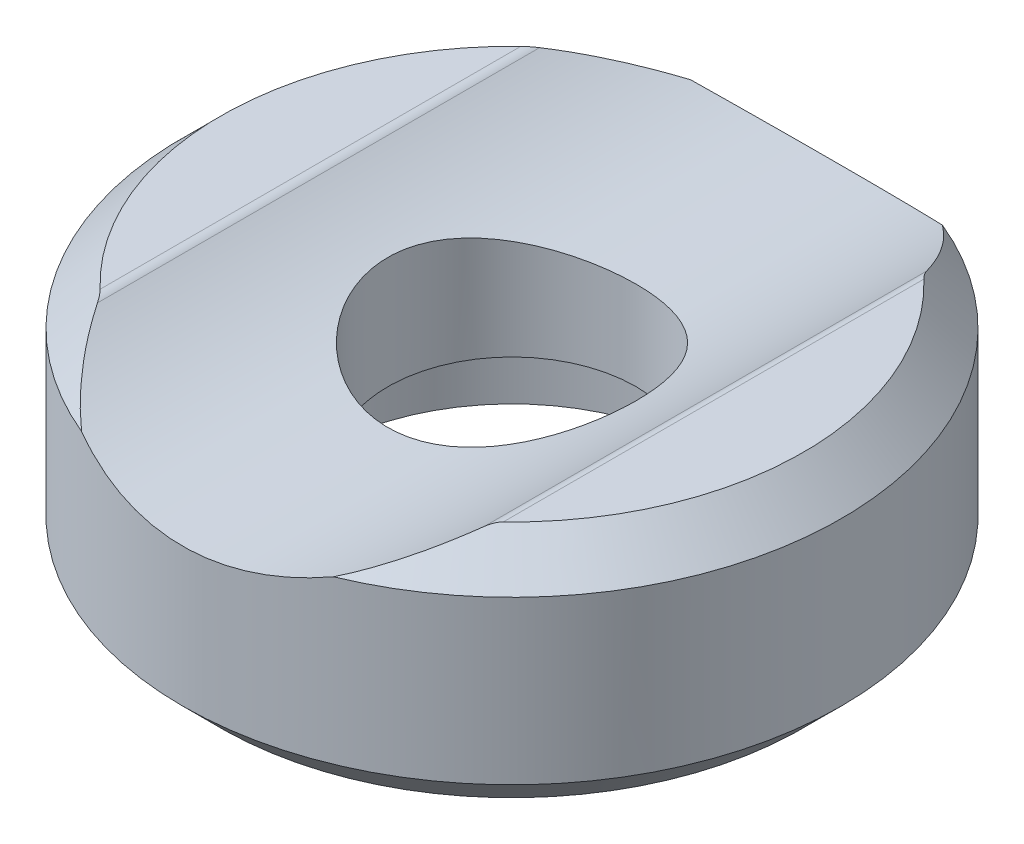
ISO-10303-21;
HEADER;
FILE_DESCRIPTION(('STEP AP214'),'2;1');
FILE_NAME('part.step','',(''),(''),'','','');
FILE_SCHEMA(('AUTOMOTIVE_DESIGN { 1 0 10303 214 1 1 1 1 }'));
ENDSEC;
DATA;
#1=APPLICATION_CONTEXT('core data for automotive mechanical design processes');
#2=APPLICATION_PROTOCOL_DEFINITION('international standard','automotive_design',2000,#1);
#3=PRODUCT_CONTEXT('',#1,'mechanical');
#4=PRODUCT('Part','Part','',(#3));
#5=PRODUCT_RELATED_PRODUCT_CATEGORY('part','',(#4));
#6=PRODUCT_DEFINITION_FORMATION('','',#4);
#7=PRODUCT_DEFINITION_CONTEXT('part definition',#1,'design');
#8=PRODUCT_DEFINITION('design','',#6,#7);
#9=PRODUCT_DEFINITION_SHAPE('','',#8);
#10=(LENGTH_UNIT() NAMED_UNIT(*) SI_UNIT(.MILLI.,.METRE.));
#11=(NAMED_UNIT(*) PLANE_ANGLE_UNIT() SI_UNIT($,.RADIAN.));
#12=(NAMED_UNIT(*) SI_UNIT($,.STERADIAN.) SOLID_ANGLE_UNIT());
#13=UNCERTAINTY_MEASURE_WITH_UNIT(LENGTH_MEASURE(1.E-05),#10,'distance_accuracy_value','');
#14=(GEOMETRIC_REPRESENTATION_CONTEXT(3) GLOBAL_UNCERTAINTY_ASSIGNED_CONTEXT((#13)) GLOBAL_UNIT_ASSIGNED_CONTEXT((#10,
#11,#12)) REPRESENTATION_CONTEXT('',''));
#15=CARTESIAN_POINT('',(0.,0.,0.));
#16=DIRECTION('',(0.,0.,1.));
#17=DIRECTION('',(1.,0.,0.));
#18=AXIS2_PLACEMENT_3D('',#15,#16,#17);
#19=CARTESIAN_POINT('',(0.,0.,0.));
#20=DIRECTION('',(0.,-1.,0.));
#21=DIRECTION('',(0.,0.,-1.));
#22=AXIS2_PLACEMENT_3D('',#19,#20,#21);
#23=CYLINDRICAL_SURFACE('',#22,2.6);
#24=CARTESIAN_POINT('',(0.,3.7,-2.6));
#25=CARTESIAN_POINT('',(-0.141171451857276,3.69999755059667,-2.60000337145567));
#26=CARTESIAN_POINT('',(-0.282319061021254,3.7041888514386,-2.58846577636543));
#27=CARTESIAN_POINT('',(-0.560416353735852,3.72049212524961,-2.5427910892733));
#28=CARTESIAN_POINT('',(-0.69736629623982,3.73260360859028,-2.50865539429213));
#29=CARTESIAN_POINT('',(-0.963018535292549,3.76344161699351,-2.41913541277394));
#30=CARTESIAN_POINT('',(-1.0917355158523,3.78215595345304,-2.36379026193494));
#31=CARTESIAN_POINT('',(-1.33805364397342,3.82432000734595,-2.23361385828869));
#32=CARTESIAN_POINT('',(-1.45565204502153,3.84777089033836,-2.15877780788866));
#33=CARTESIAN_POINT('',(-1.68107704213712,3.89801451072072,-1.98862565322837));
#34=CARTESIAN_POINT('',(-1.78840139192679,3.9248969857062,-1.89267086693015));
#35=CARTESIAN_POINT('',(-1.9858324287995,3.978514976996,-1.68436129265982));
#36=CARTESIAN_POINT('',(-2.07593438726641,4.00525045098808,-1.57200201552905));
#37=CARTESIAN_POINT('',(-2.23944189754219,4.0565714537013,-1.32929973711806));
#38=CARTESIAN_POINT('',(-2.31215766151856,4.0810498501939,-1.19846713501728));
#39=CARTESIAN_POINT('',(-2.4343324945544,4.12369983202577,-0.925404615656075));
#40=CARTESIAN_POINT('',(-2.4838000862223,4.14187372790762,-0.783178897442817));
#41=CARTESIAN_POINT('',(-2.55612524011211,4.16890265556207,-0.497128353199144));
#42=CARTESIAN_POINT('',(-2.57993578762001,4.17809015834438,-0.353576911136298));
#43=CARTESIAN_POINT('',(-2.60325097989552,4.18708290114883,-0.064244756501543));
#44=CARTESIAN_POINT('',(-2.60276474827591,4.18689166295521,0.0815350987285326));
#45=CARTESIAN_POINT('',(-2.57823269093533,4.17743682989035,0.362679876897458));
#46=CARTESIAN_POINT('',(-2.555480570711,4.16867142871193,0.498177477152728));
#47=CARTESIAN_POINT('',(-2.48919153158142,4.14387946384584,0.763283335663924));
#48=CARTESIAN_POINT('',(-2.445651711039,4.1278518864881,0.892890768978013));
#49=CARTESIAN_POINT('',(-2.33826694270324,4.09002299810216,1.14527717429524));
#50=CARTESIAN_POINT('',(-2.27407027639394,4.06812286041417,1.26789103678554));
#51=CARTESIAN_POINT('',(-2.12743878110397,4.02105229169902,1.50099285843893));
#52=CARTESIAN_POINT('',(-2.04499798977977,3.99588079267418,1.61147683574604));
#53=CARTESIAN_POINT('',(-1.85819817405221,3.94319963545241,1.8243827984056));
#54=CARTESIAN_POINT('',(-1.75279759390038,3.91564173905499,1.9258811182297));
#55=CARTESIAN_POINT('',(-1.52614487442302,3.86264166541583,2.11002476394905));
#56=CARTESIAN_POINT('',(-1.40489064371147,3.83719976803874,2.19266759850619));
#57=CARTESIAN_POINT('',(-1.14775464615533,3.79085596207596,2.33767516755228));
#58=CARTESIAN_POINT('',(-1.01169856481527,3.77001949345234,2.39975318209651));
#59=CARTESIAN_POINT('',(-0.730136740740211,3.73571557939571,2.49983963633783));
#60=CARTESIAN_POINT('',(-0.584634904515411,3.72224510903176,2.53785795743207));
#61=CARTESIAN_POINT('',(-0.296101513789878,3.70471216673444,2.58701851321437));
#62=CARTESIAN_POINT('',(-0.153308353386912,3.70021420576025,2.59940597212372));
#63=CARTESIAN_POINT('',(0.132369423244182,3.69980101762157,2.60055187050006));
#64=CARTESIAN_POINT('',(0.275254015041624,3.70388404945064,2.5893151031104));
#65=CARTESIAN_POINT('',(0.551815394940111,3.71988630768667,2.54449247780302));
#66=CARTESIAN_POINT('',(0.685639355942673,3.73152559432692,2.51170451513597));
#67=CARTESIAN_POINT('',(0.945807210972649,3.76119017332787,2.42574240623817));
#68=CARTESIAN_POINT('',(1.07215013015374,3.77921629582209,2.37256560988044));
#69=CARTESIAN_POINT('',(1.31779546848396,3.82049592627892,2.24567814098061));
#70=CARTESIAN_POINT('',(1.43679475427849,3.84388373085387,2.17142562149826));
#71=CARTESIAN_POINT('',(1.66102906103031,3.89327560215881,2.00511452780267));
#72=CARTESIAN_POINT('',(1.76625925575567,3.91928058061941,1.91304973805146));
#73=CARTESIAN_POINT('',(1.9658693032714,3.97276318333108,1.70789928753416));
#74=CARTESIAN_POINT('',(2.0593630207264,4.00024489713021,1.59395028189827));
#75=CARTESIAN_POINT('',(2.22605424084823,4.05220263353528,1.35141877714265));
#76=CARTESIAN_POINT('',(2.29925058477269,4.07667848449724,1.22283544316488));
#77=CARTESIAN_POINT('',(2.42317593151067,4.119693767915,0.954017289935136));
#78=CARTESIAN_POINT('',(2.47386671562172,4.13822308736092,0.813763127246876));
#79=CARTESIAN_POINT('',(2.55061337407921,4.16679266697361,0.525863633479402));
#80=CARTESIAN_POINT('',(2.57668300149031,4.17683766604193,0.378222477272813));
#81=CARTESIAN_POINT('',(2.60226836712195,4.18670207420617,0.089262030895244));
#82=CARTESIAN_POINT('',(2.6032809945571,4.18709789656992,-0.0519062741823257));
#83=CARTESIAN_POINT('',(2.58250686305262,4.1790789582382,-0.332286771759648));
#84=CARTESIAN_POINT('',(2.56072195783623,4.17066491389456,-0.47149912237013));
#85=CARTESIAN_POINT('',(2.49610272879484,4.14643753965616,-0.740332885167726));
#86=CARTESIAN_POINT('',(2.4538353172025,4.13082401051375,-0.870110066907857));
#87=CARTESIAN_POINT('',(2.34993510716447,4.0940594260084,-1.12081678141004));
#88=CARTESIAN_POINT('',(2.28829759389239,4.07290702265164,-1.24174415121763));
#89=CARTESIAN_POINT('',(2.14385467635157,4.02614271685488,-1.4778277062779));
#90=CARTESIAN_POINT('',(2.06015154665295,4.00036175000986,-1.59240080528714));
#91=CARTESIAN_POINT('',(1.87538624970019,3.94786788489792,-1.8063551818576));
#92=CARTESIAN_POINT('',(1.77431877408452,3.92115470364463,-1.90573179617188));
#93=CARTESIAN_POINT('',(1.55180297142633,3.86824426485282,-2.09138722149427));
#94=CARTESIAN_POINT('',(1.42960197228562,3.84213543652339,-2.17679285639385));
#95=CARTESIAN_POINT('',(1.17167812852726,3.79476667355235,-2.3257999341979));
#96=CARTESIAN_POINT('',(1.03595586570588,3.77350653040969,-2.38940231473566));
#97=CARTESIAN_POINT('',(0.752926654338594,3.73804002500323,-2.49320995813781));
#98=CARTESIAN_POINT('',(0.605494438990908,3.72392670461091,-2.53310772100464));
#99=CARTESIAN_POINT('',(0.305364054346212,3.70490991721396,-2.58649546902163));
#100=CARTESIAN_POINT('',(0.152668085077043,3.70000264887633,-2.59999635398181));
#101=CARTESIAN_POINT('',(0.,3.7,-2.6));
#102=B_SPLINE_CURVE_WITH_KNOTS('',3,(#24,#25,#26,#27,#28,#29,#30,#31,#32,#33,#34,#35,#36,#37,
#38,#39,#40,#41,#42,#43,#44,#45,#46,#47,#48,#49,#50,#51,#52,#53,#54,#55,#56,#57,#58,#59,#60,#61,
#62,#63,#64,#65,#66,#67,#68,#69,#70,#71,#72,#73,#74,#75,#76,#77,#78,#79,#80,#81,#82,#83,#84,#85,
#86,#87,#88,#89,#90,#91,#92,#93,#94,#95,#96,#97,#98,#99,#100,#101),.UNSPECIFIED.,.T.,.F.,(4,2,2,
2,2,2,2,2,2,2,2,2,2,2,2,2,2,2,2,2,2,2,2,2,2,2,2,2,2,2,2,2,2,2,2,2,2,2,4),(0.,0.422951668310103,
0.845877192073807,1.26802606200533,1.69027894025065,2.12768783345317,2.56521665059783,
3.01796453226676,3.47054631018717,3.90566750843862,4.34062531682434,4.75172570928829,
5.1628835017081,5.58144944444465,6.000152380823,6.44479799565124,6.88950232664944,
7.34016874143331,7.79064994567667,8.21867607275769,8.64661536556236,9.05954141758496,
9.47252115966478,9.89726667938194,10.3221606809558,10.7698718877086,11.2176086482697,
11.6661028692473,12.1143464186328,12.535743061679,12.9571054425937,13.3674193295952,
13.7778331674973,14.2085881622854,14.639475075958,15.0913390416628,15.5431835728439,
16.0007683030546,16.4581640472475),.UNSPECIFIED.);
#103=CARTESIAN_POINT('',(0.,3.7,-2.6));
#104=VERTEX_POINT('',#103);
#105=EDGE_CURVE('E211',#104,#104,#102,.T.);
#106=ORIENTED_EDGE('',*,*,#105,.T.);
#107=EDGE_LOOP('',(#106));
#108=FACE_BOUND('',#107,.T.);
#109=CARTESIAN_POINT('',(0.,1.84120486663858,0.));
#110=DIRECTION('',(0.,-1.,0.));
#111=DIRECTION('',(0.,0.,-1.));
#112=AXIS2_PLACEMENT_3D('',#109,#110,#111);
#113=CIRCLE('',#112,2.6);
#114=CARTESIAN_POINT('',(0.,1.84120486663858,-2.6));
#115=VERTEX_POINT('',#114);
#116=EDGE_CURVE('E18',#115,#115,#113,.T.);
#117=ORIENTED_EDGE('',*,*,#116,.T.);
#118=EDGE_LOOP('',(#117));
#119=FACE_BOUND('',#118,.T.);
#120=ADVANCED_FACE('F14',(#108,#119),#23,.F.);
#121=CARTESIAN_POINT('',(0.,1.00000000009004,0.));
#122=DIRECTION('',(0.,-1.,0.));
#123=DIRECTION('',(0.,0.,-1.));
#124=AXIS2_PLACEMENT_3D('',#121,#122,#123);
#125=CONICAL_SURFACE('',#124,3.99999999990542,1.02974425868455);
#126=ORIENTED_EDGE('',*,*,#116,.F.);
#127=EDGE_LOOP('',(#126));
#128=FACE_BOUND('',#127,.T.);
#129=CARTESIAN_POINT('',(0.,1.,0.));
#130=DIRECTION('',(0.,-1.,0.));
#131=DIRECTION('',(0.,0.,-1.));
#132=AXIS2_PLACEMENT_3D('',#129,#130,#131);
#133=CIRCLE('',#132,4.);
#134=CARTESIAN_POINT('',(0.,1.,-4.));
#135=VERTEX_POINT('',#134);
#136=EDGE_CURVE('E204',#135,#135,#133,.T.);
#137=ORIENTED_EDGE('',*,*,#136,.T.);
#138=EDGE_LOOP('',(#137));
#139=FACE_BOUND('',#138,.T.);
#140=ADVANCED_FACE('F278',(#128,#139),#125,.F.);
#141=CARTESIAN_POINT('',(0.,0.,0.));
#142=DIRECTION('',(0.,-1.,0.));
#143=DIRECTION('',(0.,0.,-1.));
#144=AXIS2_PLACEMENT_3D('',#141,#142,#143);
#145=CYLINDRICAL_SURFACE('',#144,4.);
#146=ORIENTED_EDGE('',*,*,#136,.F.);
#147=EDGE_LOOP('',(#146));
#148=FACE_BOUND('',#147,.T.);
#149=CARTESIAN_POINT('',(0.,0.,0.));
#150=DIRECTION('',(0.,-1.,0.));
#151=DIRECTION('',(0.,0.,-1.));
#152=AXIS2_PLACEMENT_3D('',#149,#150,#151);
#153=CIRCLE('',#152,4.);
#154=CARTESIAN_POINT('',(0.,0.,-4.));
#155=VERTEX_POINT('',#154);
#156=EDGE_CURVE('E85',#155,#155,#153,.F.);
#157=ORIENTED_EDGE('',*,*,#156,.F.);
#158=EDGE_LOOP('',(#157));
#159=FACE_BOUND('',#158,.T.);
#160=ADVANCED_FACE('F281',(#148,#159),#145,.F.);
#161=CARTESIAN_POINT('',(6.1,5.,0.));
#162=DIRECTION('',(0.,1.,0.));
#163=DIRECTION('',(0.,0.,1.));
#164=AXIS2_PLACEMENT_3D('',#161,#162,#163);
#165=PLANE('',#164);
#166=CARTESIAN_POINT('',(0.,4.99999999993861,0.));
#167=DIRECTION('',(0.,-1.,0.));
#168=DIRECTION('',(0.,0.,-1.));
#169=AXIS2_PLACEMENT_3D('',#166,#167,#168);
#170=CIRCLE('',#169,6.10000000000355);
#171=CARTESIAN_POINT('',(4.22018956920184,4.99999999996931,-4.40454310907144));
#172=VERTEX_POINT('',#171);
#173=CARTESIAN_POINT('',(4.22018956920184,4.99999999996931,4.40454310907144));
#174=VERTEX_POINT('',#173);
#175=EDGE_CURVE('E165',#172,#174,#170,.T.);
#176=ORIENTED_EDGE('',*,*,#175,.F.);
#177=DIRECTION('',(0.,0.,-1.));
#178=VECTOR('',#177,1.);
#179=CARTESIAN_POINT('',(4.22018956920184,5.,7.9));
#180=LINE('',#179,#178);
#181=EDGE_CURVE('E80',#174,#172,#180,.T.);
#182=ORIENTED_EDGE('',*,*,#181,.F.);
#183=EDGE_LOOP('',(#176,#182));
#184=FACE_BOUND('',#183,.T.);
#185=ADVANCED_FACE('F145',(#184),#165,.T.);
#186=CARTESIAN_POINT('',(4.22018956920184,4.7,7.9));
#187=DIRECTION('',(0.,0.,-1.));
#188=DIRECTION('',(-1.,0.,0.));
#189=AXIS2_PLACEMENT_3D('',#186,#187,#188);
#190=CYLINDRICAL_SURFACE('',#189,0.299999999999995);
#191=CARTESIAN_POINT('',(4.05138198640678,4.94799999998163,-4.62962287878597));
#192=CARTESIAN_POINT('',(4.06015765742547,4.95396523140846,-4.61401675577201));
#193=CARTESIAN_POINT('',(4.06933969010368,4.95954155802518,-4.59847896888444));
#194=CARTESIAN_POINT('',(4.08858821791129,4.96981778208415,-4.56759076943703));
#195=CARTESIAN_POINT('',(4.0986574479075,4.97451481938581,-4.55224111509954));
#196=CARTESIAN_POINT('',(4.11948376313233,4.9828094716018,-4.5221879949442));
#197=CARTESIAN_POINT('',(4.13022281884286,4.98642740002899,-4.50747773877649));
#198=CARTESIAN_POINT('',(4.15261675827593,4.99252103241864,-4.47854863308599));
#199=CARTESIAN_POINT('',(4.16427023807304,4.99499844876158,-4.46432907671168));
#200=CARTESIAN_POINT('',(4.18335840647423,4.99781289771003,-4.44255663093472));
#201=CARTESIAN_POINT('',(4.19045340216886,4.99861221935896,-4.4347653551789));
#202=CARTESIAN_POINT('',(4.2050321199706,4.99970589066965,-4.41943499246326));
#203=CARTESIAN_POINT('',(4.21251781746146,4.99999735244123,-4.41189758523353));
#204=CARTESIAN_POINT('',(4.22018956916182,5.,-4.40454310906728));
#205=B_SPLINE_CURVE_WITH_KNOTS('',3,(#191,#192,#193,#194,#195,#196,#197,#198,#199,#200,#201,
#202,#203,#204),.UNSPECIFIED.,.F.,.F.,(4,2,2,2,2,2,4),(0.,0.0566215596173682,0.113424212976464,
0.169078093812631,0.224648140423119,0.256332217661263,0.288195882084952),.UNSPECIFIED.);
#206=CARTESIAN_POINT('',(4.0513819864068,4.94799999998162,-4.62962287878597));
#207=VERTEX_POINT('',#206);
#208=EDGE_CURVE('E158',#207,#172,#205,.T.);
#209=ORIENTED_EDGE('',*,*,#208,.F.);
#210=DIRECTION('',(0.,0.,-1.));
#211=VECTOR('',#210,1.);
#212=CARTESIAN_POINT('',(4.05138198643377,4.948,7.9));
#213=LINE('',#212,#211);
#214=CARTESIAN_POINT('',(4.05138198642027,4.94799999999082,4.62962287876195));
#215=VERTEX_POINT('',#214);
#216=EDGE_CURVE('E188',#207,#215,#213,.F.);
#217=ORIENTED_EDGE('',*,*,#216,.T.);
#218=CARTESIAN_POINT('',(4.22018956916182,5.,4.40454310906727));
#219=CARTESIAN_POINT('',(4.20860645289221,4.99998761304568,4.41565915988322));
#220=CARTESIAN_POINT('',(4.19744912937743,4.99933022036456,4.42717153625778));
#221=CARTESIAN_POINT('',(4.17593674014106,4.99691796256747,4.45077684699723));
#222=CARTESIAN_POINT('',(4.16558010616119,4.99516530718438,4.46286856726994));
#223=CARTESIAN_POINT('',(4.1358394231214,4.98860685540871,4.4994352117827));
#224=CARTESIAN_POINT('',(4.11747800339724,4.9824896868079,4.52451003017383));
#225=CARTESIAN_POINT('',(4.09159014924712,4.97120655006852,4.56302892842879));
#226=CARTESIAN_POINT('',(4.08314651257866,4.96703146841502,4.5761817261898));
#227=CARTESIAN_POINT('',(4.06682624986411,4.95800580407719,4.60274271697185));
#228=CARTESIAN_POINT('',(4.05895391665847,4.95315077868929,4.61615204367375));
#229=CARTESIAN_POINT('',(4.05138198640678,4.94799999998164,4.62962287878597));
#230=B_SPLINE_CURVE_WITH_KNOTS('',3,(#218,#219,#220,#221,#222,#223,#224,#225,#226,#227,#228,
#229),.UNSPECIFIED.,.F.,.F.,(4,2,2,2,2,4),(0.,0.0480894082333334,0.0960821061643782,
0.190777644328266,0.239293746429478,0.288143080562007),.UNSPECIFIED.);
#231=EDGE_CURVE('E150',#174,#215,#230,.T.);
#232=ORIENTED_EDGE('',*,*,#231,.F.);
#233=ORIENTED_EDGE('',*,*,#181,.T.);
#234=EDGE_LOOP('',(#209,#217,#232,#233));
#235=FACE_BOUND('',#234,.T.);
#236=ADVANCED_FACE('F139',(#235),#190,.T.);
#237=CARTESIAN_POINT('',(-4.22018956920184,4.7,7.9));
#238=DIRECTION('',(0.,0.,-1.));
#239=DIRECTION('',(-1.,0.,0.));
#240=AXIS2_PLACEMENT_3D('',#237,#238,#239);
#241=CYLINDRICAL_SURFACE('',#240,0.300000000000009);
#242=CARTESIAN_POINT('',(-4.22018956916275,5.00000000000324,4.40454310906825));
#243=CARTESIAN_POINT('',(-4.20860645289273,4.99998761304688,4.4156591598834));
#244=CARTESIAN_POINT('',(-4.19744912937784,4.99933022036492,4.42717153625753));
#245=CARTESIAN_POINT('',(-4.17593674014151,4.99691796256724,4.45077684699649));
#246=CARTESIAN_POINT('',(-4.1655801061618,4.99516530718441,4.46286856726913));
#247=CARTESIAN_POINT('',(-4.13583942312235,4.98860685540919,4.4994352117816));
#248=CARTESIAN_POINT('',(-4.11747800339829,4.9824896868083,4.52451003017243));
#249=CARTESIAN_POINT('',(-4.09159014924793,4.97120655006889,4.56302892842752));
#250=CARTESIAN_POINT('',(-4.08314651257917,4.9670314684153,4.57618172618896));
#251=CARTESIAN_POINT('',(-4.06682624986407,4.95800580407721,4.60274271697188));
#252=CARTESIAN_POINT('',(-4.05895391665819,4.95315077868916,4.61615204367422));
#253=CARTESIAN_POINT('',(-4.05138198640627,4.94799999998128,4.62962287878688));
#254=B_SPLINE_CURVE_WITH_KNOTS('',3,(#242,#243,#244,#245,#246,#247,#248,#249,#250,#251,#252,
#253),.UNSPECIFIED.,.F.,.F.,(4,2,2,2,2,4),(0.,0.0480894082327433,0.0960821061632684,
0.190777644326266,0.239293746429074,0.288143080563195),.UNSPECIFIED.);
#255=CARTESIAN_POINT('',(-4.22018956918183,4.9999999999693,4.40454310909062));
#256=VERTEX_POINT('',#255);
#257=CARTESIAN_POINT('',(-4.05138198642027,4.94799999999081,4.62962287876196));
#258=VERTEX_POINT('',#257);
#259=EDGE_CURVE('E79',#256,#258,#254,.T.);
#260=ORIENTED_EDGE('',*,*,#259,.T.);
#261=DIRECTION('',(0.,0.,-1.));
#262=VECTOR('',#261,1.);
#263=CARTESIAN_POINT('',(-4.05138198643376,4.948,7.9));
#264=LINE('',#263,#262);
#265=CARTESIAN_POINT('',(-4.05138198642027,4.94799999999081,-4.62962287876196));
#266=VERTEX_POINT('',#265);
#267=EDGE_CURVE('E76',#258,#266,#264,.T.);
#268=ORIENTED_EDGE('',*,*,#267,.T.);
#269=CARTESIAN_POINT('',(-4.05138198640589,4.9479999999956,-4.62962287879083));
#270=CARTESIAN_POINT('',(-4.06015765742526,4.95396523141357,-4.61401675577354));
#271=CARTESIAN_POINT('',(-4.0693396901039,4.95954155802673,-4.59847896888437));
#272=CARTESIAN_POINT('',(-4.08858821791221,4.96981778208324,-4.56759076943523));
#273=CARTESIAN_POINT('',(-4.09865744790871,4.97451481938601,-4.55224111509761));
#274=CARTESIAN_POINT('',(-4.11948376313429,4.98280947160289,-4.52218799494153));
#275=CARTESIAN_POINT('',(-4.13022281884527,4.98642740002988,-4.50747773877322));
#276=CARTESIAN_POINT('',(-4.15261675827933,4.99252103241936,-4.47854863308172));
#277=CARTESIAN_POINT('',(-4.16427023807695,4.99499844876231,-4.46432907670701));
#278=CARTESIAN_POINT('',(-4.18335840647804,4.9978128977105,-4.44255663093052));
#279=CARTESIAN_POINT('',(-4.19045340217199,4.99861221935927,-4.43476535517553));
#280=CARTESIAN_POINT('',(-4.2050321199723,4.99970589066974,-4.41943499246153));
#281=CARTESIAN_POINT('',(-4.2125178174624,4.99999735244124,-4.41189758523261));
#282=CARTESIAN_POINT('',(-4.22018956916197,5.,-4.40454310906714));
#283=B_SPLINE_CURVE_WITH_KNOTS('',3,(#269,#270,#271,#272,#273,#274,#275,#276,#277,#278,#279,
#280,#281,#282),.UNSPECIFIED.,.F.,.F.,(4,2,2,2,2,2,4),(0.,0.0566215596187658,0.113424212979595,
0.169078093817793,0.224648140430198,0.256332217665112,0.288195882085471),.UNSPECIFIED.);
#284=CARTESIAN_POINT('',(-4.22018956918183,4.9999999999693,-4.40454310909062));
#285=VERTEX_POINT('',#284);
#286=EDGE_CURVE('E68',#266,#285,#283,.T.);
#287=ORIENTED_EDGE('',*,*,#286,.T.);
#288=DIRECTION('',(0.,0.,1.));
#289=VECTOR('',#288,1.);
#290=CARTESIAN_POINT('',(-4.22018956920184,5.,0.));
#291=LINE('',#290,#289);
#292=EDGE_CURVE('E74',#256,#285,#291,.F.);
#293=ORIENTED_EDGE('',*,*,#292,.F.);
#294=EDGE_LOOP('',(#260,#268,#287,#293));
#295=FACE_BOUND('',#294,.T.);
#296=ADVANCED_FACE('F73',(#295),#241,.T.);
#297=CARTESIAN_POINT('',(6.1,5.,0.));
#298=DIRECTION('',(0.,1.,0.));
#299=DIRECTION('',(0.,0.,1.));
#300=AXIS2_PLACEMENT_3D('',#297,#298,#299);
#301=PLANE('',#300);
#302=ORIENTED_EDGE('',*,*,#292,.T.);
#303=CARTESIAN_POINT('',(0.,4.99999999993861,0.));
#304=DIRECTION('',(0.,-1.,0.));
#305=DIRECTION('',(0.,0.,-1.));
#306=AXIS2_PLACEMENT_3D('',#303,#304,#305);
#307=CIRCLE('',#306,6.10000000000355);
#308=EDGE_CURVE('E83',#256,#285,#307,.T.);
#309=ORIENTED_EDGE('',*,*,#308,.F.);
#310=EDGE_LOOP('',(#302,#309));
#311=FACE_BOUND('',#310,.T.);
#312=ADVANCED_FACE('F82',(#311),#301,.T.);
#313=CARTESIAN_POINT('',(4.,0.,0.));
#314=DIRECTION('',(0.,-1.,0.));
#315=DIRECTION('',(0.,0.,-1.));
#316=AXIS2_PLACEMENT_3D('',#313,#314,#315);
#317=PLANE('',#316);
#318=ORIENTED_EDGE('',*,*,#156,.T.);
#319=EDGE_LOOP('',(#318));
#320=FACE_BOUND('',#319,.T.);
#321=CARTESIAN_POINT('',(0.,0.,0.));
#322=DIRECTION('',(0.,1.,0.));
#323=DIRECTION('',(-1.,0.,0.));
#324=AXIS2_PLACEMENT_3D('',#321,#322,#323);
#325=CIRCLE('',#324,6.10000000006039);
#326=CARTESIAN_POINT('',(-6.10000000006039,0.,0.));
#327=VERTEX_POINT('',#326);
#328=EDGE_CURVE('E89',#327,#327,#325,.T.);
#329=ORIENTED_EDGE('',*,*,#328,.F.);
#330=EDGE_LOOP('',(#329));
#331=FACE_BOUND('',#330,.T.);
#332=ADVANCED_FACE('F169',(#320,#331),#317,.T.);
#333=CARTESIAN_POINT('',(0.,4.19999999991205,0.));
#334=DIRECTION('',(0.,-1.,0.));
#335=DIRECTION('',(0.,0.,-1.));
#336=AXIS2_PLACEMENT_3D('',#333,#334,#335);
#337=CONICAL_SURFACE('',#336,6.90000000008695,0.785398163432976);
#338=ORIENTED_EDGE('',*,*,#231,.T.);
#339=CARTESIAN_POINT('',(4.05138198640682,4.9479999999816,4.62962287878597));
#340=CARTESIAN_POINT('',(3.95882027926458,4.88502688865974,4.79424639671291));
#341=CARTESIAN_POINT('',(3.86027360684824,4.82107653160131,4.95524490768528));
#342=CARTESIAN_POINT('',(3.65123639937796,4.69327261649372,5.26742374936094));
#343=CARTESIAN_POINT('',(3.54083770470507,4.62942172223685,5.41866683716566));
#344=CARTESIAN_POINT('',(3.306814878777,4.50291653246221,5.7111776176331));
#345=CARTESIAN_POINT('',(3.18319243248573,4.44026208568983,5.85244657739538));
#346=CARTESIAN_POINT('',(2.92102872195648,4.3175569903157,6.1238095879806));
#347=CARTESIAN_POINT('',(2.78238499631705,4.25752872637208,6.25381439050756));
#348=CARTESIAN_POINT('',(2.63628526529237,4.19999999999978,6.37651942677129));
#349=B_SPLINE_CURVE_WITH_KNOTS('',3,(#339,#340,#341,#342,#343,#344,#345,#346,#347,#348),
.UNSPECIFIED.,.F.,.F.,(4,2,2,2,4),(0.,0.597258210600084,1.19018328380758,1.78303289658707,
2.38021672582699),.UNSPECIFIED.);
#350=CARTESIAN_POINT('',(2.63628526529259,4.19999999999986,6.37651942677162));
#351=VERTEX_POINT('',#350);
#352=EDGE_CURVE('E182',#215,#351,#349,.T.);
#353=ORIENTED_EDGE('',*,*,#352,.T.);
#354=CARTESIAN_POINT('',(0.,4.20000000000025,0.));
#355=DIRECTION('',(0.,-1.,0.));
#356=DIRECTION('',(0.,0.,-1.));
#357=AXIS2_PLACEMENT_3D('',#354,#355,#356);
#358=CIRCLE('',#357,6.9);
#359=CARTESIAN_POINT('',(2.63628526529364,4.20000000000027,-6.3765194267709));
#360=VERTEX_POINT('',#359);
#361=EDGE_CURVE('E208',#360,#351,#358,.T.);
#362=ORIENTED_EDGE('',*,*,#361,.F.);
#363=CARTESIAN_POINT('',(2.63628526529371,4.2000000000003,-6.37651942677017));
#364=CARTESIAN_POINT('',(2.76277390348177,4.2497947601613,-6.27031203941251));
#365=CARTESIAN_POINT('',(2.8836855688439,4.30148251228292,-6.15858946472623));
#366=CARTESIAN_POINT('',(3.11470853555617,4.40732701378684,-5.92575943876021));
#367=CARTESIAN_POINT('',(3.22482995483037,4.46148137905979,-5.80466097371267));
#368=CARTESIAN_POINT('',(3.4336941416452,4.57043109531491,-5.555910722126));
#369=CARTESIAN_POINT('',(3.53254998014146,4.6252125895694,-5.42834694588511));
#370=CARTESIAN_POINT('',(3.72076681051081,4.73495640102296,-5.16649405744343));
#371=CARTESIAN_POINT('',(3.81012889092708,4.7899186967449,-5.03220571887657));
#372=CARTESIAN_POINT('',(3.92190413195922,4.86181371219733,-4.85138762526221));
#373=CARTESIAN_POINT('',(3.94840233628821,4.8791118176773,-4.80748404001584));
#374=CARTESIAN_POINT('',(4.00054372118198,4.91362968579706,-4.71902214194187));
#375=CARTESIAN_POINT('',(4.02618526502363,4.9308492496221,-4.67446278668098));
#376=CARTESIAN_POINT('',(4.05138198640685,4.9479999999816,-4.629622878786));
#377=B_SPLINE_CURVE_WITH_KNOTS('',3,(#363,#364,#365,#366,#367,#368,#369,#370,#371,#372,#373,
#374,#375,#376),.UNSPECIFIED.,.F.,.F.,(4,2,2,2,2,2,4),(0.,0.51712347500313,1.03375731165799,
1.54463707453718,2.05545819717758,2.21780941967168,2.3804548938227),.UNSPECIFIED.);
#378=EDGE_CURVE('E175',#360,#207,#377,.T.);
#379=ORIENTED_EDGE('',*,*,#378,.T.);
#380=ORIENTED_EDGE('',*,*,#208,.T.);
#381=ORIENTED_EDGE('',*,*,#175,.T.);
#382=EDGE_LOOP('',(#338,#353,#362,#379,#380,#381));
#383=FACE_BOUND('',#382,.T.);
#384=ADVANCED_FACE('F166',(#383),#337,.T.);
#385=CARTESIAN_POINT('',(0.,10.9,7.9));
#386=DIRECTION('',(0.,0.,-1.));
#387=DIRECTION('',(-1.,0.,0.));
#388=AXIS2_PLACEMENT_3D('',#385,#386,#387);
#389=CYLINDRICAL_SURFACE('',#388,7.2);
#390=ORIENTED_EDGE('',*,*,#105,.F.);
#391=EDGE_LOOP('',(#390));
#392=FACE_BOUND('',#391,.T.);
#393=CARTESIAN_POINT('',(-2.63628526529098,4.19999999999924,-6.37651942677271));
#394=CARTESIAN_POINT('',(-2.50820689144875,4.14958822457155,-6.42948722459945));
#395=CARTESIAN_POINT('',(-2.37740258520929,4.10237738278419,-6.47903220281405));
#396=CARTESIAN_POINT('',(-2.11084430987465,4.01494598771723,-6.57070494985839));
#397=CARTESIAN_POINT('',(-1.97508696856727,3.97473030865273,-6.61282754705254));
#398=CARTESIAN_POINT('',(-1.69909936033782,3.90189528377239,-6.68906535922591));
#399=CARTESIAN_POINT('',(-1.558862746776,3.86928731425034,-6.72316858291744));
#400=CARTESIAN_POINT('',(-1.27495082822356,3.81230269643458,-6.78273755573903));
#401=CARTESIAN_POINT('',(-1.13127634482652,3.78792410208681,-6.80820534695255));
#402=CARTESIAN_POINT('',(-0.840779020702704,3.74774983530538,-6.85016197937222));
#403=CARTESIAN_POINT('',(-0.693945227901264,3.73199184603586,-6.86661139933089));
#404=CARTESIAN_POINT('',(-0.398836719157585,3.70953234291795,-6.89005344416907));
#405=CARTESIAN_POINT('',(-0.250562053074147,3.70283051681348,-6.89704639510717));
#406=CARTESIAN_POINT('',(0.046072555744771,3.69862149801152,-6.90143845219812));
#407=CARTESIAN_POINT('',(0.194432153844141,3.70110269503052,-6.898849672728));
#408=CARTESIAN_POINT('',(0.490231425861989,3.71518304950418,-6.8841556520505));
#409=CARTESIAN_POINT('',(0.637671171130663,3.72678149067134,-6.87205115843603));
#410=CARTESIAN_POINT('',(0.923296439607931,3.7580715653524,-6.83938319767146));
#411=CARTESIAN_POINT('',(1.061580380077,3.77733695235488,-6.8192651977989));
#412=CARTESIAN_POINT('',(1.33547991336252,3.82357497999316,-6.77095562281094));
#413=CARTESIAN_POINT('',(1.47109432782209,3.85055094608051,-6.74276056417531));
#414=CARTESIAN_POINT('',(1.73871172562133,3.91174464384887,-6.67875742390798));
#415=CARTESIAN_POINT('',(1.87071748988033,3.94595661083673,-6.64295540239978));
#416=CARTESIAN_POINT('',(2.13060559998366,4.02113286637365,-6.5642174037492));
#417=CARTESIAN_POINT('',(2.25848834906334,4.06209649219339,-6.52128212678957));
#418=CARTESIAN_POINT('',(2.42665058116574,4.12110557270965,-6.45936777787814));
#419=CARTESIAN_POINT('',(2.4689987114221,4.13641646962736,-6.44329785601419));
#420=CARTESIAN_POINT('',(2.55308447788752,4.16770710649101,-6.41044402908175));
#421=CARTESIAN_POINT('',(2.5948229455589,4.18368579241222,-6.39366124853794));
#422=CARTESIAN_POINT('',(2.6362852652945,4.20000000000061,-6.37651942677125));
#423=B_SPLINE_CURVE_WITH_KNOTS('',3,(#393,#394,#395,#396,#397,#398,#399,#400,#401,#402,#403,
#404,#405,#406,#407,#408,#409,#410,#411,#412,#413,#414,#415,#416,#417,#418,#419,#420,#421,#422),
.UNSPECIFIED.,.F.,.F.,(4,2,2,2,2,2,2,2,2,2,2,2,2,2,4),(0.,0.442413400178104,0.885133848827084,
1.32851214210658,1.77178551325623,2.2169813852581,2.66216190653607,3.10677976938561,
3.55136270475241,3.97407284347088,4.3969655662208,4.81952264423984,5.2420382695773,
5.38546596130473,5.5286752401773),.UNSPECIFIED.);
#424=CARTESIAN_POINT('',(-2.63628526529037,4.19999999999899,-6.37651942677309));
#425=VERTEX_POINT('',#424);
#426=EDGE_CURVE('E96',#425,#360,#423,.T.);
#427=ORIENTED_EDGE('',*,*,#426,.F.);
#428=CARTESIAN_POINT('',(-4.0513819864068,4.9479999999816,-4.62962287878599));
#429=CARTESIAN_POINT('',(-3.95882027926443,4.88502688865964,-4.79424639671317));
#430=CARTESIAN_POINT('',(-3.86027360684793,4.82107653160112,-4.95524490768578));
#431=CARTESIAN_POINT('',(-3.6512363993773,4.69327261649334,-5.26742374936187));
#432=CARTESIAN_POINT('',(-3.54083770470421,4.62942172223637,-5.4186668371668));
#433=CARTESIAN_POINT('',(-3.30681487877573,4.50291653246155,-5.7111776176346));
#434=CARTESIAN_POINT('',(-3.18319243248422,4.44026208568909,-5.85244657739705));
#435=CARTESIAN_POINT('',(-2.92102872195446,4.3175569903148,-6.12380958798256));
#436=CARTESIAN_POINT('',(-2.78238499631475,4.25752872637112,-6.25381439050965));
#437=CARTESIAN_POINT('',(-2.63628526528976,4.19999999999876,-6.37651942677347));
#438=B_SPLINE_CURVE_WITH_KNOTS('',3,(#428,#429,#430,#431,#432,#433,#434,#435,#436,#437),
.UNSPECIFIED.,.F.,.F.,(4,2,2,2,4),(0.,0.597258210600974,1.19018328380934,1.78303289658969,
2.38021672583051),.UNSPECIFIED.);
#439=EDGE_CURVE('E98',#266,#425,#438,.T.);
#440=ORIENTED_EDGE('',*,*,#439,.F.);
#441=ORIENTED_EDGE('',*,*,#267,.F.);
#442=CARTESIAN_POINT('',(-2.63628526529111,4.19999999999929,6.37651942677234));
#443=CARTESIAN_POINT('',(-2.76277390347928,4.24979476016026,6.27031203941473));
#444=CARTESIAN_POINT('',(-2.8836855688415,4.30148251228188,6.15858946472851));
#445=CARTESIAN_POINT('',(-3.11470853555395,4.40732701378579,5.92575943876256));
#446=CARTESIAN_POINT('',(-3.22482995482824,4.46148137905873,5.80466097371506));
#447=CARTESIAN_POINT('',(-3.43369414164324,4.57043109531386,5.55591072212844));
#448=CARTESIAN_POINT('',(-3.53254998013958,4.62521258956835,5.42834694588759));
#449=CARTESIAN_POINT('',(-3.72076681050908,4.73495640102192,5.16649405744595));
#450=CARTESIAN_POINT('',(-3.81012889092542,4.78991869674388,5.03220571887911));
#451=CARTESIAN_POINT('',(-3.92190413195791,4.8618137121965,4.85138762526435));
#452=CARTESIAN_POINT('',(-3.94840233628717,4.87911181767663,4.80748404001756));
#453=CARTESIAN_POINT('',(-4.00054372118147,4.91362968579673,4.71902214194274));
#454=CARTESIAN_POINT('',(-4.02618526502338,4.93084924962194,4.67446278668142));
#455=CARTESIAN_POINT('',(-4.05138198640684,4.9479999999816,4.629622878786));
#456=B_SPLINE_CURVE_WITH_KNOTS('',3,(#442,#443,#444,#445,#446,#447,#448,#449,#450,#451,#452,
#453,#454,#455),.UNSPECIFIED.,.F.,.F.,(4,2,2,2,2,2,4),(0.,0.517123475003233,1.03375731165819,
1.54463707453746,2.05545819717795,2.21780941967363,2.38045489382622),.UNSPECIFIED.);
#457=CARTESIAN_POINT('',(-2.63628526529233,4.19999999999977,6.37651942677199));
#458=VERTEX_POINT('',#457);
#459=EDGE_CURVE('E34',#458,#258,#456,.T.);
#460=ORIENTED_EDGE('',*,*,#459,.F.);
#461=CARTESIAN_POINT('',(2.63628526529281,4.19999999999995,6.37651942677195));
#462=CARTESIAN_POINT('',(2.50820689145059,4.14958822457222,6.42948722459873));
#463=CARTESIAN_POINT('',(2.37740258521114,4.10237738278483,6.47903220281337));
#464=CARTESIAN_POINT('',(2.11084430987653,4.0149459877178,6.57070494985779));
#465=CARTESIAN_POINT('',(1.97508696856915,3.97473030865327,6.61282754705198));
#466=CARTESIAN_POINT('',(1.69909936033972,3.90189528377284,6.68906535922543));
#467=CARTESIAN_POINT('',(1.55886274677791,3.86928731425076,6.72316858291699));
#468=CARTESIAN_POINT('',(1.27495082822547,3.81230269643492,6.78273755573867));
#469=CARTESIAN_POINT('',(1.13127634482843,3.78792410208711,6.80820534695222));
#470=CARTESIAN_POINT('',(0.840779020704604,3.7477498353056,6.85016197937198));
#471=CARTESIAN_POINT('',(0.693945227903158,3.73199184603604,6.8666113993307));
#472=CARTESIAN_POINT('',(0.398836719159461,3.70953234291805,6.89005344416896));
#473=CARTESIAN_POINT('',(0.250562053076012,3.70283051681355,6.8970463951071));
#474=CARTESIAN_POINT('',(-0.0460725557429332,3.69862149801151,6.90143845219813));
#475=CARTESIAN_POINT('',(-0.194432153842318,3.70110269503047,6.89884967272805));
#476=CARTESIAN_POINT('',(-0.490231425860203,3.71518304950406,6.88415565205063));
#477=CARTESIAN_POINT('',(-0.637671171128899,3.72678149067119,6.8720511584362));
#478=CARTESIAN_POINT('',(-0.923296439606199,3.75807156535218,6.83938319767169));
#479=CARTESIAN_POINT('',(-1.06158038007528,3.77733695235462,6.81926519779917));
#480=CARTESIAN_POINT('',(-1.33547991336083,3.82357497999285,6.77095562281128));
#481=CARTESIAN_POINT('',(-1.47109432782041,3.85055094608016,6.74276056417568));
#482=CARTESIAN_POINT('',(-1.73871172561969,3.91174464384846,6.6787574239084));
#483=CARTESIAN_POINT('',(-1.8707174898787,3.9459566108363,6.64295540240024));
#484=CARTESIAN_POINT('',(-2.13060559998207,4.02113286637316,6.56421740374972));
#485=CARTESIAN_POINT('',(-2.25848834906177,4.06209649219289,6.52128212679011));
#486=CARTESIAN_POINT('',(-2.42665058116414,4.12110557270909,6.45936777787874));
#487=CARTESIAN_POINT('',(-2.46899871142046,4.13641646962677,6.44329785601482));
#488=CARTESIAN_POINT('',(-2.55308447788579,4.16770710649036,6.41044402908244));
#489=CARTESIAN_POINT('',(-2.59482294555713,4.18368579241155,6.39366124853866));
#490=CARTESIAN_POINT('',(-2.63628526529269,4.19999999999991,6.376519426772));
#491=B_SPLINE_CURVE_WITH_KNOTS('',3,(#461,#462,#463,#464,#465,#466,#467,#468,#469,#470,#471,
#472,#473,#474,#475,#476,#477,#478,#479,#480,#481,#482,#483,#484,#485,#486,#487,#488,#489,#490),
.UNSPECIFIED.,.F.,.F.,(4,2,2,2,2,2,2,2,2,2,2,2,2,2,4),(0.,0.442413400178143,0.885133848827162,
1.3285121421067,1.77178551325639,2.2169813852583,2.66216190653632,3.10677976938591,
3.55136270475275,3.97407284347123,4.39696556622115,4.81952264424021,5.24203826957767,
5.38546596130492,5.52867524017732),.UNSPECIFIED.);
#492=EDGE_CURVE('E213',#351,#458,#491,.T.);
#493=ORIENTED_EDGE('',*,*,#492,.F.);
#494=ORIENTED_EDGE('',*,*,#352,.F.);
#495=ORIENTED_EDGE('',*,*,#216,.F.);
#496=ORIENTED_EDGE('',*,*,#378,.F.);
#497=EDGE_LOOP('',(#427,#440,#441,#460,#493,#494,#495,#496));
#498=FACE_BOUND('',#497,.T.);
#499=ADVANCED_FACE('F113',(#392,#498),#389,.F.);
#500=CARTESIAN_POINT('',(0.,4.19999999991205,0.));
#501=DIRECTION('',(0.,-1.,0.));
#502=DIRECTION('',(0.,0.,-1.));
#503=AXIS2_PLACEMENT_3D('',#500,#501,#502);
#504=CONICAL_SURFACE('',#503,6.90000000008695,0.785398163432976);
#505=ORIENTED_EDGE('',*,*,#259,.F.);
#506=ORIENTED_EDGE('',*,*,#308,.T.);
#507=ORIENTED_EDGE('',*,*,#286,.F.);
#508=ORIENTED_EDGE('',*,*,#439,.T.);
#509=CARTESIAN_POINT('',(0.,4.20000000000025,0.));
#510=DIRECTION('',(0.,-1.,0.));
#511=DIRECTION('',(0.,0.,-1.));
#512=AXIS2_PLACEMENT_3D('',#509,#510,#511);
#513=CIRCLE('',#512,6.9);
#514=EDGE_CURVE('E25',#458,#425,#513,.T.);
#515=ORIENTED_EDGE('',*,*,#514,.F.);
#516=ORIENTED_EDGE('',*,*,#459,.T.);
#517=EDGE_LOOP('',(#505,#506,#507,#508,#515,#516));
#518=FACE_BOUND('',#517,.T.);
#519=ADVANCED_FACE('F87',(#518),#504,.T.);
#520=CARTESIAN_POINT('',(0.,0.799999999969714,0.));
#521=DIRECTION('',(0.,1.,0.));
#522=DIRECTION('',(-1.,0.,0.));
#523=AXIS2_PLACEMENT_3D('',#520,#521,#522);
#524=CONICAL_SURFACE('',#523,6.9000000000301,0.785398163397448);
#525=ORIENTED_EDGE('',*,*,#328,.T.);
#526=EDGE_LOOP('',(#525));
#527=FACE_BOUND('',#526,.T.);
#528=CARTESIAN_POINT('',(0.,0.8,0.));
#529=DIRECTION('',(0.,-1.,0.));
#530=DIRECTION('',(0.,0.,-1.));
#531=AXIS2_PLACEMENT_3D('',#528,#529,#530);
#532=CIRCLE('',#531,6.9);
#533=CARTESIAN_POINT('',(0.,0.8,-6.9));
#534=VERTEX_POINT('',#533);
#535=EDGE_CURVE('E9',#534,#534,#532,.F.);
#536=ORIENTED_EDGE('',*,*,#535,.F.);
#537=EDGE_LOOP('',(#536));
#538=FACE_BOUND('',#537,.T.);
#539=ADVANCED_FACE('F119',(#527,#538),#524,.T.);
#540=CARTESIAN_POINT('',(0.,0.,0.));
#541=DIRECTION('',(0.,-1.,0.));
#542=DIRECTION('',(0.,0.,-1.));
#543=AXIS2_PLACEMENT_3D('',#540,#541,#542);
#544=CYLINDRICAL_SURFACE('',#543,6.9);
#545=ORIENTED_EDGE('',*,*,#535,.T.);
#546=EDGE_LOOP('',(#545));
#547=FACE_BOUND('',#546,.T.);
#548=ORIENTED_EDGE('',*,*,#492,.T.);
#549=ORIENTED_EDGE('',*,*,#514,.T.);
#550=ORIENTED_EDGE('',*,*,#426,.T.);
#551=ORIENTED_EDGE('',*,*,#361,.T.);
#552=EDGE_LOOP('',(#548,#549,#550,#551));
#553=FACE_BOUND('',#552,.T.);
#554=ADVANCED_FACE('F218',(#547,#553),#544,.T.);
#555=CLOSED_SHELL('',(#120,#140,#160,#185,#236,#296,#312,#332,#384,#499,#519,#539,#554));
#556=MANIFOLD_SOLID_BREP('B1',#555);
#557=ADVANCED_BREP_SHAPE_REPRESENTATION('',(#18,#556),#14);
#558=SHAPE_DEFINITION_REPRESENTATION(#9,#557);
ENDSEC;
END-ISO-10303-21;
